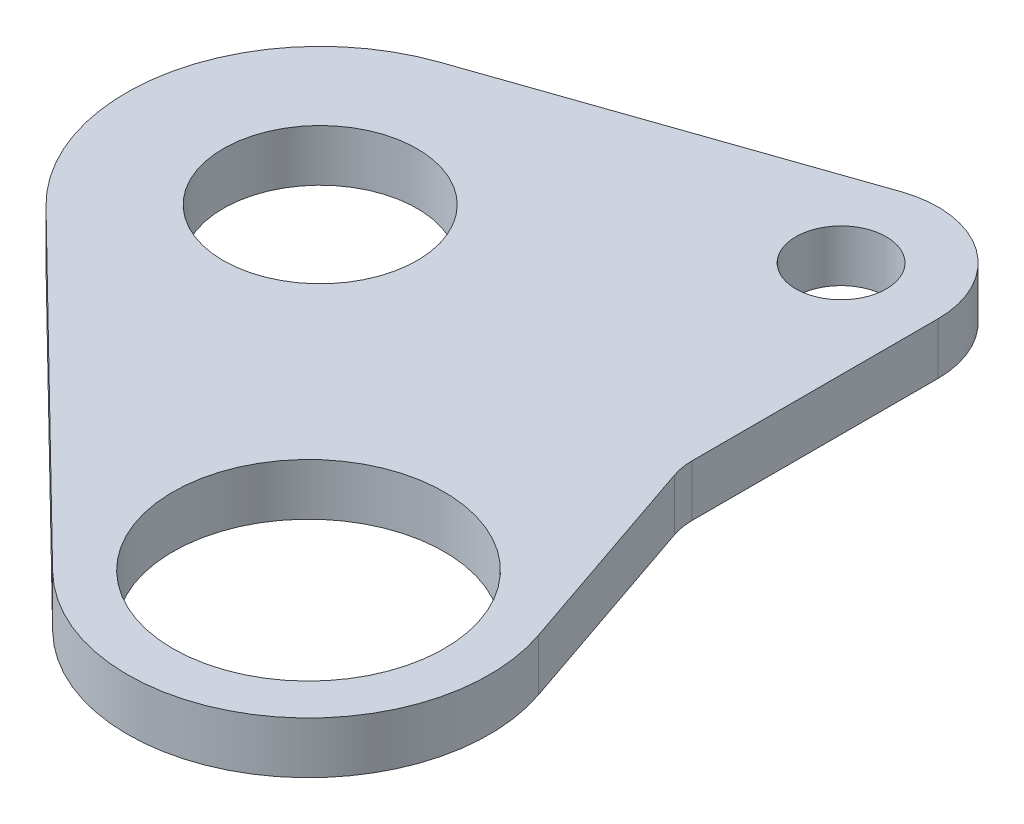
ISO-10303-21;
HEADER;
FILE_DESCRIPTION(('STEP AP214'),'2;1');
FILE_NAME('part.step','',(''),(''),'','','');
FILE_SCHEMA(('AUTOMOTIVE_DESIGN { 1 0 10303 214 1 1 1 1 }'));
ENDSEC;
DATA;
#1=APPLICATION_CONTEXT('core data for automotive mechanical design processes');
#2=APPLICATION_PROTOCOL_DEFINITION('international standard','automotive_design',2000,#1);
#3=PRODUCT_CONTEXT('',#1,'mechanical');
#4=PRODUCT('Part','Part','',(#3));
#5=PRODUCT_RELATED_PRODUCT_CATEGORY('part','',(#4));
#6=PRODUCT_DEFINITION_FORMATION('','',#4);
#7=PRODUCT_DEFINITION_CONTEXT('part definition',#1,'design');
#8=PRODUCT_DEFINITION('design','',#6,#7);
#9=PRODUCT_DEFINITION_SHAPE('','',#8);
#10=(LENGTH_UNIT() NAMED_UNIT(*) SI_UNIT(.MILLI.,.METRE.));
#11=(NAMED_UNIT(*) PLANE_ANGLE_UNIT() SI_UNIT($,.RADIAN.));
#12=(NAMED_UNIT(*) SI_UNIT($,.STERADIAN.) SOLID_ANGLE_UNIT());
#13=UNCERTAINTY_MEASURE_WITH_UNIT(LENGTH_MEASURE(1.E-05),#10,'distance_accuracy_value','');
#14=(GEOMETRIC_REPRESENTATION_CONTEXT(3) GLOBAL_UNCERTAINTY_ASSIGNED_CONTEXT((#13)) GLOBAL_UNIT_ASSIGNED_CONTEXT((#10,
#11,#12)) REPRESENTATION_CONTEXT('',''));
#15=CARTESIAN_POINT('',(0.,0.,0.));
#16=DIRECTION('',(0.,0.,1.));
#17=DIRECTION('',(1.,0.,0.));
#18=AXIS2_PLACEMENT_3D('',#15,#16,#17);
#19=CARTESIAN_POINT('',(25.,8.,-44.3611963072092));
#20=DIRECTION('',(0.,1.,0.));
#21=DIRECTION('',(0.,0.,1.));
#22=AXIS2_PLACEMENT_3D('',#19,#20,#21);
#23=PLANE('',#22);
#24=CARTESIAN_POINT('',(-48.1,8.,-49.9));
#25=DIRECTION('',(0.,1.,0.));
#26=DIRECTION('',(0.,0.,1.));
#27=AXIS2_PLACEMENT_3D('',#24,#25,#26);
#28=CIRCLE('',#27,15.);
#29=CARTESIAN_POINT('',(-48.1,8.,-34.9));
#30=VERTEX_POINT('',#29);
#31=EDGE_CURVE('E228',#30,#30,#28,.T.);
#32=ORIENTED_EDGE('',*,*,#31,.F.);
#33=EDGE_LOOP('',(#32));
#34=FACE_BOUND('',#33,.T.);
#35=CARTESIAN_POINT('',(25.,8.,-44.3611963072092));
#36=DIRECTION('',(0.,-1.,0.));
#37=DIRECTION('',(0.,0.,1.));
#38=AXIS2_PLACEMENT_3D('',#35,#36,#37);
#39=CIRCLE('',#38,10.);
#40=CARTESIAN_POINT('',(15.5370931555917,8.,-41.1280254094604));
#41=VERTEX_POINT('',#40);
#42=CARTESIAN_POINT('',(15.,8.,-44.3611963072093));
#43=VERTEX_POINT('',#42);
#44=EDGE_CURVE('E133',#41,#43,#39,.T.);
#45=ORIENTED_EDGE('',*,*,#44,.T.);
#46=DIRECTION('',(0.,0.,-1.));
#47=VECTOR('',#46,1.);
#48=CARTESIAN_POINT('',(15.,8.,-82.4));
#49=LINE('',#48,#47);
#50=CARTESIAN_POINT('',(15.,8.,-82.4));
#51=VERTEX_POINT('',#50);
#52=EDGE_CURVE('E110',#43,#51,#49,.T.);
#53=ORIENTED_EDGE('',*,*,#52,.T.);
#54=CARTESIAN_POINT('',(0.,8.,-82.4));
#55=DIRECTION('',(0.,1.,0.));
#56=DIRECTION('',(0.,0.,-1.));
#57=AXIS2_PLACEMENT_3D('',#54,#55,#56);
#58=CIRCLE('',#57,15.);
#59=CARTESIAN_POINT('',(-4.90110495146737,8.,-96.5767122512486));
#60=VERTEX_POINT('',#59);
#61=EDGE_CURVE('E136',#51,#60,#58,.T.);
#62=ORIENTED_EDGE('',*,*,#61,.T.);
#63=DIRECTION('',(-0.94511415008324,0.,0.326740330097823));
#64=VECTOR('',#63,1.);
#65=CARTESIAN_POINT('',(-57.9022099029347,8.,-78.2534245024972));
#66=LINE('',#65,#64);
#67=CARTESIAN_POINT('',(-57.9022099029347,8.,-78.2534245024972));
#68=VERTEX_POINT('',#67);
#69=EDGE_CURVE('E138',#60,#68,#66,.T.);
#70=ORIENTED_EDGE('',*,*,#69,.T.);
#71=CARTESIAN_POINT('',(-48.1,8.,-49.9));
#72=DIRECTION('',(0.,1.,0.));
#73=DIRECTION('',(0.,0.,-1.));
#74=AXIS2_PLACEMENT_3D('',#71,#72,#73);
#75=CIRCLE('',#74,30.);
#76=CARTESIAN_POINT('',(-69.0893990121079,8.,-28.4653288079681));
#77=VERTEX_POINT('',#76);
#78=EDGE_CURVE('E140',#68,#77,#75,.T.);
#79=ORIENTED_EDGE('',*,*,#78,.T.);
#80=DIRECTION('',(0.714489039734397,0.,0.699646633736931));
#81=VECTOR('',#80,1.);
#82=CARTESIAN_POINT('',(-19.5901057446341,8.,20.0056931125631));
#83=LINE('',#82,#81);
#84=CARTESIAN_POINT('',(-19.5901057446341,8.,20.0056931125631));
#85=VERTEX_POINT('',#84);
#86=EDGE_CURVE('E142',#77,#85,#83,.T.);
#87=ORIENTED_EDGE('',*,*,#86,.T.);
#88=CARTESIAN_POINT('',(0.,8.,0.));
#89=DIRECTION('',(0.,1.,0.));
#90=DIRECTION('',(0.,0.,-1.));
#91=AXIS2_PLACEMENT_3D('',#88,#89,#90);
#92=CIRCLE('',#91,28.);
#93=CARTESIAN_POINT('',(26.4961391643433,8.,-9.05287851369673));
#94=VERTEX_POINT('',#93);
#95=EDGE_CURVE('E51',#85,#94,#92,.T.);
#96=ORIENTED_EDGE('',*,*,#95,.T.);
#97=DIRECTION('',(-0.323317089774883,0.,-0.946290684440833));
#98=VECTOR('',#97,1.);
#99=CARTESIAN_POINT('',(15.5370931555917,8.,-41.1280254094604));
#100=LINE('',#99,#98);
#101=EDGE_CURVE('E46',#94,#41,#100,.T.);
#102=ORIENTED_EDGE('',*,*,#101,.T.);
#103=EDGE_LOOP('',(#45,#53,#62,#70,#79,#87,#96,#102));
#104=FACE_BOUND('',#103,.T.);
#105=CARTESIAN_POINT('',(0.,8.,0.));
#106=DIRECTION('',(0.,1.,0.));
#107=DIRECTION('',(0.,0.,1.));
#108=AXIS2_PLACEMENT_3D('',#105,#106,#107);
#109=CIRCLE('',#108,21.);
#110=CARTESIAN_POINT('',(0.,8.,21.));
#111=VERTEX_POINT('',#110);
#112=EDGE_CURVE('E115',#111,#111,#109,.T.);
#113=ORIENTED_EDGE('',*,*,#112,.F.);
#114=EDGE_LOOP('',(#113));
#115=FACE_BOUND('',#114,.T.);
#116=CARTESIAN_POINT('',(0.,8.,-82.4));
#117=DIRECTION('',(0.,1.,0.));
#118=DIRECTION('',(0.,0.,1.));
#119=AXIS2_PLACEMENT_3D('',#116,#117,#118);
#120=CIRCLE('',#119,7.00000000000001);
#121=CARTESIAN_POINT('',(0.,8.,-75.4));
#122=VERTEX_POINT('',#121);
#123=EDGE_CURVE('E217',#122,#122,#120,.T.);
#124=ORIENTED_EDGE('',*,*,#123,.F.);
#125=EDGE_LOOP('',(#124));
#126=FACE_BOUND('',#125,.T.);
#127=ADVANCED_FACE('F31',(#34,#104,#115,#126),#23,.T.);
#128=CARTESIAN_POINT('',(25.,0.,-44.3611963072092));
#129=DIRECTION('',(0.,1.,0.));
#130=DIRECTION('',(0.,0.,1.));
#131=AXIS2_PLACEMENT_3D('',#128,#129,#130);
#132=PLANE('',#131);
#133=CARTESIAN_POINT('',(-48.1,0.,-49.9));
#134=DIRECTION('',(0.,1.,0.));
#135=DIRECTION('',(0.,0.,1.));
#136=AXIS2_PLACEMENT_3D('',#133,#134,#135);
#137=CIRCLE('',#136,15.);
#138=CARTESIAN_POINT('',(-48.1,0.,-34.9));
#139=VERTEX_POINT('',#138);
#140=EDGE_CURVE('E223',#139,#139,#137,.T.);
#141=ORIENTED_EDGE('',*,*,#140,.T.);
#142=EDGE_LOOP('',(#141));
#143=FACE_BOUND('',#142,.T.);
#144=CARTESIAN_POINT('',(25.,0.,-44.3611963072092));
#145=DIRECTION('',(0.,-1.,0.));
#146=DIRECTION('',(0.,0.,1.));
#147=AXIS2_PLACEMENT_3D('',#144,#145,#146);
#148=CIRCLE('',#147,10.);
#149=CARTESIAN_POINT('',(15.5370931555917,0.,-41.1280254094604));
#150=VERTEX_POINT('',#149);
#151=CARTESIAN_POINT('',(15.,0.,-44.3611963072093));
#152=VERTEX_POINT('',#151);
#153=EDGE_CURVE('E101',#150,#152,#148,.T.);
#154=ORIENTED_EDGE('',*,*,#153,.F.);
#155=DIRECTION('',(-0.323317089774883,0.,-0.946290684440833));
#156=VECTOR('',#155,1.);
#157=CARTESIAN_POINT('',(15.5370931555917,0.,-41.1280254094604));
#158=LINE('',#157,#156);
#159=CARTESIAN_POINT('',(26.4961391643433,0.,-9.05287851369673));
#160=VERTEX_POINT('',#159);
#161=EDGE_CURVE('E131',#160,#150,#158,.T.);
#162=ORIENTED_EDGE('',*,*,#161,.F.);
#163=CARTESIAN_POINT('',(0.,0.,0.));
#164=DIRECTION('',(0.,1.,0.));
#165=DIRECTION('',(0.,0.,-1.));
#166=AXIS2_PLACEMENT_3D('',#163,#164,#165);
#167=CIRCLE('',#166,28.);
#168=CARTESIAN_POINT('',(-19.5901057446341,0.,20.0056931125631));
#169=VERTEX_POINT('',#168);
#170=EDGE_CURVE('E129',#169,#160,#167,.T.);
#171=ORIENTED_EDGE('',*,*,#170,.F.);
#172=DIRECTION('',(0.714489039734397,0.,0.699646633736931));
#173=VECTOR('',#172,1.);
#174=CARTESIAN_POINT('',(-19.5901057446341,0.,20.0056931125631));
#175=LINE('',#174,#173);
#176=CARTESIAN_POINT('',(-69.0893990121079,0.,-28.4653288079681));
#177=VERTEX_POINT('',#176);
#178=EDGE_CURVE('E127',#177,#169,#175,.T.);
#179=ORIENTED_EDGE('',*,*,#178,.F.);
#180=CARTESIAN_POINT('',(-48.1,0.,-49.9));
#181=DIRECTION('',(0.,1.,0.));
#182=DIRECTION('',(0.,0.,-1.));
#183=AXIS2_PLACEMENT_3D('',#180,#181,#182);
#184=CIRCLE('',#183,30.);
#185=CARTESIAN_POINT('',(-57.9022099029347,0.,-78.2534245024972));
#186=VERTEX_POINT('',#185);
#187=EDGE_CURVE('E125',#186,#177,#184,.T.);
#188=ORIENTED_EDGE('',*,*,#187,.F.);
#189=DIRECTION('',(-0.94511415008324,0.,0.326740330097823));
#190=VECTOR('',#189,1.);
#191=CARTESIAN_POINT('',(-57.9022099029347,0.,-78.2534245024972));
#192=LINE('',#191,#190);
#193=CARTESIAN_POINT('',(-4.90110495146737,0.,-96.5767122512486));
#194=VERTEX_POINT('',#193);
#195=EDGE_CURVE('E123',#194,#186,#192,.T.);
#196=ORIENTED_EDGE('',*,*,#195,.F.);
#197=CARTESIAN_POINT('',(0.,0.,-82.4));
#198=DIRECTION('',(0.,1.,0.));
#199=DIRECTION('',(0.,0.,-1.));
#200=AXIS2_PLACEMENT_3D('',#197,#198,#199);
#201=CIRCLE('',#200,15.);
#202=CARTESIAN_POINT('',(15.,0.,-82.4));
#203=VERTEX_POINT('',#202);
#204=EDGE_CURVE('E103',#203,#194,#201,.T.);
#205=ORIENTED_EDGE('',*,*,#204,.F.);
#206=DIRECTION('',(0.,0.,-1.));
#207=VECTOR('',#206,1.);
#208=CARTESIAN_POINT('',(15.,0.,-82.4));
#209=LINE('',#208,#207);
#210=EDGE_CURVE('E96',#152,#203,#209,.T.);
#211=ORIENTED_EDGE('',*,*,#210,.F.);
#212=EDGE_LOOP('',(#154,#162,#171,#179,#188,#196,#205,#211));
#213=FACE_BOUND('',#212,.T.);
#214=CARTESIAN_POINT('',(0.,0.,0.));
#215=DIRECTION('',(0.,1.,0.));
#216=DIRECTION('',(0.,0.,1.));
#217=AXIS2_PLACEMENT_3D('',#214,#215,#216);
#218=CIRCLE('',#217,21.);
#219=CARTESIAN_POINT('',(0.,0.,21.));
#220=VERTEX_POINT('',#219);
#221=EDGE_CURVE('E118',#220,#220,#218,.T.);
#222=ORIENTED_EDGE('',*,*,#221,.T.);
#223=EDGE_LOOP('',(#222));
#224=FACE_BOUND('',#223,.T.);
#225=CARTESIAN_POINT('',(0.,0.,-82.4));
#226=DIRECTION('',(0.,1.,0.));
#227=DIRECTION('',(0.,0.,1.));
#228=AXIS2_PLACEMENT_3D('',#225,#226,#227);
#229=CIRCLE('',#228,7.00000000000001);
#230=CARTESIAN_POINT('',(0.,0.,-75.4));
#231=VERTEX_POINT('',#230);
#232=EDGE_CURVE('E220',#231,#231,#229,.T.);
#233=ORIENTED_EDGE('',*,*,#232,.T.);
#234=EDGE_LOOP('',(#233));
#235=FACE_BOUND('',#234,.T.);
#236=ADVANCED_FACE('F97',(#143,#213,#224,#235),#132,.F.);
#237=CARTESIAN_POINT('',(25.,8.,-44.3611963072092));
#238=DIRECTION('',(0.,-1.,0.));
#239=DIRECTION('',(0.,0.,-1.));
#240=AXIS2_PLACEMENT_3D('',#237,#238,#239);
#241=CYLINDRICAL_SURFACE('',#240,10.);
#242=ORIENTED_EDGE('',*,*,#153,.T.);
#243=DIRECTION('',(0.,-1.,0.));
#244=VECTOR('',#243,1.);
#245=CARTESIAN_POINT('',(15.,8.,-44.3611963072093));
#246=LINE('',#245,#244);
#247=EDGE_CURVE('E11',#43,#152,#246,.T.);
#248=ORIENTED_EDGE('',*,*,#247,.F.);
#249=ORIENTED_EDGE('',*,*,#44,.F.);
#250=DIRECTION('',(0.,-1.,0.));
#251=VECTOR('',#250,1.);
#252=CARTESIAN_POINT('',(15.5370931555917,8.,-41.1280254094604));
#253=LINE('',#252,#251);
#254=EDGE_CURVE('E114',#41,#150,#253,.T.);
#255=ORIENTED_EDGE('',*,*,#254,.T.);
#256=EDGE_LOOP('',(#242,#248,#249,#255));
#257=FACE_BOUND('',#256,.T.);
#258=ADVANCED_FACE('F33',(#257),#241,.F.);
#259=CARTESIAN_POINT('',(15.,8.,-82.4));
#260=DIRECTION('',(-1.,0.,0.));
#261=DIRECTION('',(0.,0.,1.));
#262=AXIS2_PLACEMENT_3D('',#259,#260,#261);
#263=PLANE('',#262);
#264=ORIENTED_EDGE('',*,*,#210,.T.);
#265=DIRECTION('',(0.,-1.,0.));
#266=VECTOR('',#265,1.);
#267=CARTESIAN_POINT('',(15.,8.,-82.4));
#268=LINE('',#267,#266);
#269=EDGE_CURVE('E39',#51,#203,#268,.T.);
#270=ORIENTED_EDGE('',*,*,#269,.F.);
#271=ORIENTED_EDGE('',*,*,#52,.F.);
#272=ORIENTED_EDGE('',*,*,#247,.T.);
#273=EDGE_LOOP('',(#264,#270,#271,#272));
#274=FACE_BOUND('',#273,.T.);
#275=ADVANCED_FACE('F109',(#274),#263,.F.);
#276=CARTESIAN_POINT('',(0.,8.,-82.4));
#277=DIRECTION('',(0.,-1.,0.));
#278=DIRECTION('',(0.,0.,-1.));
#279=AXIS2_PLACEMENT_3D('',#276,#277,#278);
#280=CYLINDRICAL_SURFACE('',#279,15.);
#281=ORIENTED_EDGE('',*,*,#204,.T.);
#282=DIRECTION('',(0.,-1.,0.));
#283=VECTOR('',#282,1.);
#284=CARTESIAN_POINT('',(-4.90110495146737,8.,-96.5767122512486));
#285=LINE('',#284,#283);
#286=EDGE_CURVE('E159',#60,#194,#285,.T.);
#287=ORIENTED_EDGE('',*,*,#286,.F.);
#288=ORIENTED_EDGE('',*,*,#61,.F.);
#289=ORIENTED_EDGE('',*,*,#269,.T.);
#290=EDGE_LOOP('',(#281,#287,#288,#289));
#291=FACE_BOUND('',#290,.T.);
#292=ADVANCED_FACE('F163',(#291),#280,.T.);
#293=CARTESIAN_POINT('',(-57.9022099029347,8.,-78.2534245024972));
#294=DIRECTION('',(0.326740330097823,0.,0.94511415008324));
#295=DIRECTION('',(0.94511415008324,0.,-0.326740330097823));
#296=AXIS2_PLACEMENT_3D('',#293,#294,#295);
#297=PLANE('',#296);
#298=ORIENTED_EDGE('',*,*,#195,.T.);
#299=DIRECTION('',(0.,-1.,0.));
#300=VECTOR('',#299,1.);
#301=CARTESIAN_POINT('',(-57.9022099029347,8.,-78.2534245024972));
#302=LINE('',#301,#300);
#303=EDGE_CURVE('E156',#68,#186,#302,.T.);
#304=ORIENTED_EDGE('',*,*,#303,.F.);
#305=ORIENTED_EDGE('',*,*,#69,.F.);
#306=ORIENTED_EDGE('',*,*,#286,.T.);
#307=EDGE_LOOP('',(#298,#304,#305,#306));
#308=FACE_BOUND('',#307,.T.);
#309=ADVANCED_FACE('F171',(#308),#297,.F.);
#310=CARTESIAN_POINT('',(-48.1,8.,-49.9));
#311=DIRECTION('',(0.,-1.,0.));
#312=DIRECTION('',(0.,0.,-1.));
#313=AXIS2_PLACEMENT_3D('',#310,#311,#312);
#314=CYLINDRICAL_SURFACE('',#313,30.);
#315=ORIENTED_EDGE('',*,*,#187,.T.);
#316=DIRECTION('',(0.,-1.,0.));
#317=VECTOR('',#316,1.);
#318=CARTESIAN_POINT('',(-69.0893990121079,8.,-28.4653288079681));
#319=LINE('',#318,#317);
#320=EDGE_CURVE('E153',#77,#177,#319,.T.);
#321=ORIENTED_EDGE('',*,*,#320,.F.);
#322=ORIENTED_EDGE('',*,*,#78,.F.);
#323=ORIENTED_EDGE('',*,*,#303,.T.);
#324=EDGE_LOOP('',(#315,#321,#322,#323));
#325=FACE_BOUND('',#324,.T.);
#326=ADVANCED_FACE('F174',(#325),#314,.T.);
#327=CARTESIAN_POINT('',(-19.5901057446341,8.,20.0056931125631));
#328=DIRECTION('',(0.699646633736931,0.,-0.714489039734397));
#329=DIRECTION('',(-0.714489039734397,0.,-0.699646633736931));
#330=AXIS2_PLACEMENT_3D('',#327,#328,#329);
#331=PLANE('',#330);
#332=ORIENTED_EDGE('',*,*,#178,.T.);
#333=DIRECTION('',(0.,-1.,0.));
#334=VECTOR('',#333,1.);
#335=CARTESIAN_POINT('',(-19.5901057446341,8.,20.0056931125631));
#336=LINE('',#335,#334);
#337=EDGE_CURVE('E150',#85,#169,#336,.T.);
#338=ORIENTED_EDGE('',*,*,#337,.F.);
#339=ORIENTED_EDGE('',*,*,#86,.F.);
#340=ORIENTED_EDGE('',*,*,#320,.T.);
#341=EDGE_LOOP('',(#332,#338,#339,#340));
#342=FACE_BOUND('',#341,.T.);
#343=ADVANCED_FACE('F179',(#342),#331,.F.);
#344=CARTESIAN_POINT('',(0.,8.,0.));
#345=DIRECTION('',(0.,-1.,0.));
#346=DIRECTION('',(0.,0.,-1.));
#347=AXIS2_PLACEMENT_3D('',#344,#345,#346);
#348=CYLINDRICAL_SURFACE('',#347,28.);
#349=ORIENTED_EDGE('',*,*,#170,.T.);
#350=DIRECTION('',(0.,-1.,0.));
#351=VECTOR('',#350,1.);
#352=CARTESIAN_POINT('',(26.4961391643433,8.,-9.05287851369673));
#353=LINE('',#352,#351);
#354=EDGE_CURVE('E147',#94,#160,#353,.T.);
#355=ORIENTED_EDGE('',*,*,#354,.F.);
#356=ORIENTED_EDGE('',*,*,#95,.F.);
#357=ORIENTED_EDGE('',*,*,#337,.T.);
#358=EDGE_LOOP('',(#349,#355,#356,#357));
#359=FACE_BOUND('',#358,.T.);
#360=ADVANCED_FACE('F182',(#359),#348,.T.);
#361=CARTESIAN_POINT('',(15.5370931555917,8.,-41.1280254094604));
#362=DIRECTION('',(-0.946290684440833,0.,0.323317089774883));
#363=DIRECTION('',(0.323317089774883,0.,0.946290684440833));
#364=AXIS2_PLACEMENT_3D('',#361,#362,#363);
#365=PLANE('',#364);
#366=ORIENTED_EDGE('',*,*,#161,.T.);
#367=ORIENTED_EDGE('',*,*,#254,.F.);
#368=ORIENTED_EDGE('',*,*,#101,.F.);
#369=ORIENTED_EDGE('',*,*,#354,.T.);
#370=EDGE_LOOP('',(#366,#367,#368,#369));
#371=FACE_BOUND('',#370,.T.);
#372=ADVANCED_FACE('F184',(#371),#365,.F.);
#373=CARTESIAN_POINT('',(0.,8.,0.));
#374=DIRECTION('',(0.,-1.,0.));
#375=DIRECTION('',(0.,0.,-1.));
#376=AXIS2_PLACEMENT_3D('',#373,#374,#375);
#377=CYLINDRICAL_SURFACE('',#376,21.);
#378=ORIENTED_EDGE('',*,*,#112,.T.);
#379=EDGE_LOOP('',(#378));
#380=FACE_BOUND('',#379,.T.);
#381=ORIENTED_EDGE('',*,*,#221,.F.);
#382=EDGE_LOOP('',(#381));
#383=FACE_BOUND('',#382,.T.);
#384=ADVANCED_FACE('F186',(#380,#383),#377,.F.);
#385=CARTESIAN_POINT('',(-48.1,8.,-49.9));
#386=DIRECTION('',(0.,-1.,0.));
#387=DIRECTION('',(0.,0.,-1.));
#388=AXIS2_PLACEMENT_3D('',#385,#386,#387);
#389=CYLINDRICAL_SURFACE('',#388,15.);
#390=ORIENTED_EDGE('',*,*,#31,.T.);
#391=EDGE_LOOP('',(#390));
#392=FACE_BOUND('',#391,.T.);
#393=ORIENTED_EDGE('',*,*,#140,.F.);
#394=EDGE_LOOP('',(#393));
#395=FACE_BOUND('',#394,.T.);
#396=ADVANCED_FACE('F192',(#392,#395),#389,.F.);
#397=CARTESIAN_POINT('',(0.,8.,-82.4));
#398=DIRECTION('',(0.,-1.,0.));
#399=DIRECTION('',(0.,0.,-1.));
#400=AXIS2_PLACEMENT_3D('',#397,#398,#399);
#401=CYLINDRICAL_SURFACE('',#400,7.00000000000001);
#402=ORIENTED_EDGE('',*,*,#123,.T.);
#403=EDGE_LOOP('',(#402));
#404=FACE_BOUND('',#403,.T.);
#405=ORIENTED_EDGE('',*,*,#232,.F.);
#406=EDGE_LOOP('',(#405));
#407=FACE_BOUND('',#406,.T.);
#408=ADVANCED_FACE('F208',(#404,#407),#401,.F.);
#409=CLOSED_SHELL('',(#127,#236,#258,#275,#292,#309,#326,#343,#360,#372,#384,#396,#408));
#410=MANIFOLD_SOLID_BREP('B2',#409);
#411=ADVANCED_BREP_SHAPE_REPRESENTATION('',(#18,#410),#14);
#412=SHAPE_DEFINITION_REPRESENTATION(#9,#411);
ENDSEC;
END-ISO-10303-21;
